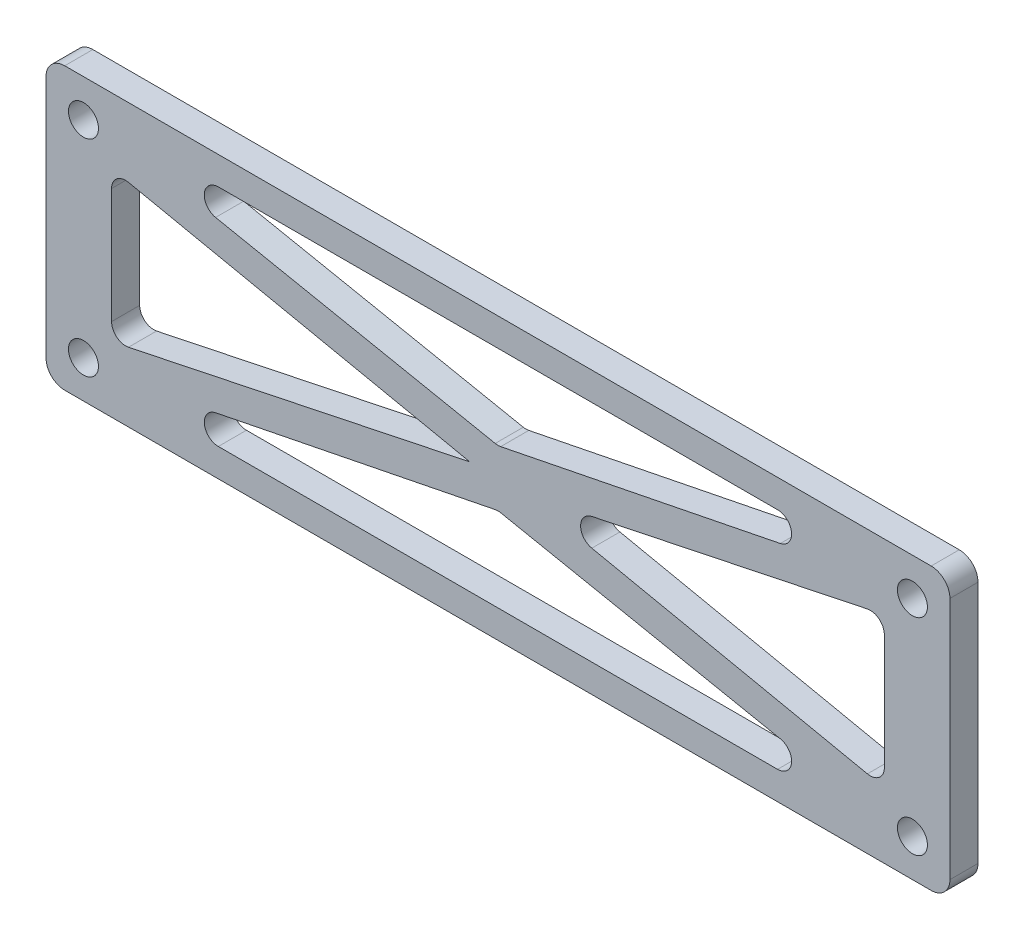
from build123d import *

# Parameters (mm, degrees)
SKETCH_1_W               = 96.501554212
SKETCH_1_H               = 30
EXTRUDE_1_DEPTH          = 3
SKETCH_2_R               = 1.6
CUT_EXTRUDE_1_DEPTH      = 51.617561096
MIRROR_2_COPY_1_SKETCH_R = 1.6
MIRROR_2_COPY_1_DEPTH    = 51.617561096
CUT_EXTRUDE_2_DEPTH      = 51.617561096
CUT_EXTRUDE_2_DEPTH_BACK = 51.617561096
FILLET_2_R               = 2


with BuildPart() as part:
    # Sketch 1 → Extrude 1 (new body)
    with BuildSketch(Plane.XY):
        Rectangle(SKETCH_1_W, SKETCH_1_H)
    extrude(amount=EXTRUDE_1_DEPTH)

    # Sketch 2 → Cut-Extrude 1 (cut, through all)
    with BuildSketch(Plane.XY.offset(3)):
        with Locations((44.250777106, 11)):
            Circle(SKETCH_2_R)
    cut_extrude_1 = extrude(amount=-CUT_EXTRUDE_1_DEPTH, mode=Mode.SUBTRACT)

    # Mirror 1: Cut-Extrude 1 across plane
    add(cut_extrude_1.mirror(Plane.ZX), mode=Mode.SUBTRACT)

    # Mirror 2: Cut-Extrude 1 across plane
    add(cut_extrude_1.mirror(Plane(origin=(0, 0, 0), x_dir=(0, 0, 1), z_dir=(1, 0, 0))), mode=Mode.SUBTRACT)

    # Mirror 2 copy 1 sketch → Mirror 2 copy 1 (cut, through all)
    with BuildSketch(Plane(origin=(0, 0, 3), x_dir=(-1, 0, 0), z_dir=(0, 0, 1))):
        with Locations((44.250777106, 11)):
            Circle(MIRROR_2_COPY_1_SKETCH_R)
    extrude(amount=-MIRROR_2_COPY_1_DEPTH, mode=Mode.SUBTRACT)

    # Sketch 3 → Cut-Extrude 2 (cut, two sides: drawn at the far end of the back side and taken through both)
    with BuildSketch(Plane.XY.offset(3).offset(-CUT_EXTRUDE_2_DEPTH_BACK)):
        with BuildLine():
            Line((39.443702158, 7.622057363), (10.020126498, 1.468231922))
            ThreePointArc((10.020126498, 1.468231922), (8.827201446, 0), (10.020126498, -1.468231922))
            Line((10.020126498, -1.468231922), (39.443702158, -7.622057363))
            ThreePointArc((39.443702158, -7.622057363), (40.696659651, -7.318001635), (41.250777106, -6.153825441))
            Line((41.250777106, -6.153825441), (41.250777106, 6.153825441))
            ThreePointArc((41.250777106, 6.153825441), (40.696659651, 7.318001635), (39.443702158, 7.622057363))
        make_face()
        with BuildLine():
            Line((30.145644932, 9.029128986), (0.294174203, 3.058834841))
            ThreePointArc((0.294174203, 3.058834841), (0, 3.029705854), (-0.294174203, 3.058834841))
            Line((-0.294174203, 3.058834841), (-30.145644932, 9.029128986))
            ThreePointArc((-30.145644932, 9.029128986), (-31.34417072, 10.647806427), (-29.85147073, 12))
            Line((-29.85147073, 12), (29.85147073, 12))
            ThreePointArc((29.85147073, 12), (31.34417072, 10.647806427), (30.145644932, 9.029128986))
        make_face()
        with BuildLine():
            Line((-41.250777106, -6.153825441), (-41.250777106, 6.153825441))
            ThreePointArc((-41.250777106, 6.153825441), (-40.696659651, 7.318001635), (-39.443702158, 7.622057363))
            Line((-39.443702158, 7.622057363), (-3, 0))
            Line((-3, 0), (-39.443702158, -7.622057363))
            ThreePointArc((-39.443702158, -7.622057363), (-40.696659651, -7.318001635), (-41.250777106, -6.153825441))
        make_face()
        with BuildLine():
            Line((-0.294174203, -3.058834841), (-30.145644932, -9.029128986))
            ThreePointArc((-30.145644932, -9.029128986), (-31.34417072, -10.647806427), (-29.85147073, -12))
            Line((-29.85147073, -12), (29.85147073, -12))
            ThreePointArc((29.85147073, -12), (31.34417072, -10.647806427), (30.145644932, -9.029128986))
            Line((30.145644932, -9.029128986), (0.294174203, -3.058834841))
            ThreePointArc((0.294174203, -3.058834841), (0, -3.029705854), (-0.294174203, -3.058834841))
        make_face()
    extrude(amount=CUT_EXTRUDE_2_DEPTH + CUT_EXTRUDE_2_DEPTH_BACK, mode=Mode.SUBTRACT)

    # Fillet 2
    fillet_2_edges = [part.edges().sort_by_distance(p)[0] for p in [
        (-48.250777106, -15, 1.5),
        (48.250777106, -15, 1.5),
        (48.250777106, 15, 1.5),
        (-48.250777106, 15, 1.5),
    ]]
    fillet(fillet_2_edges, radius=FILLET_2_R)


solid = part.part
